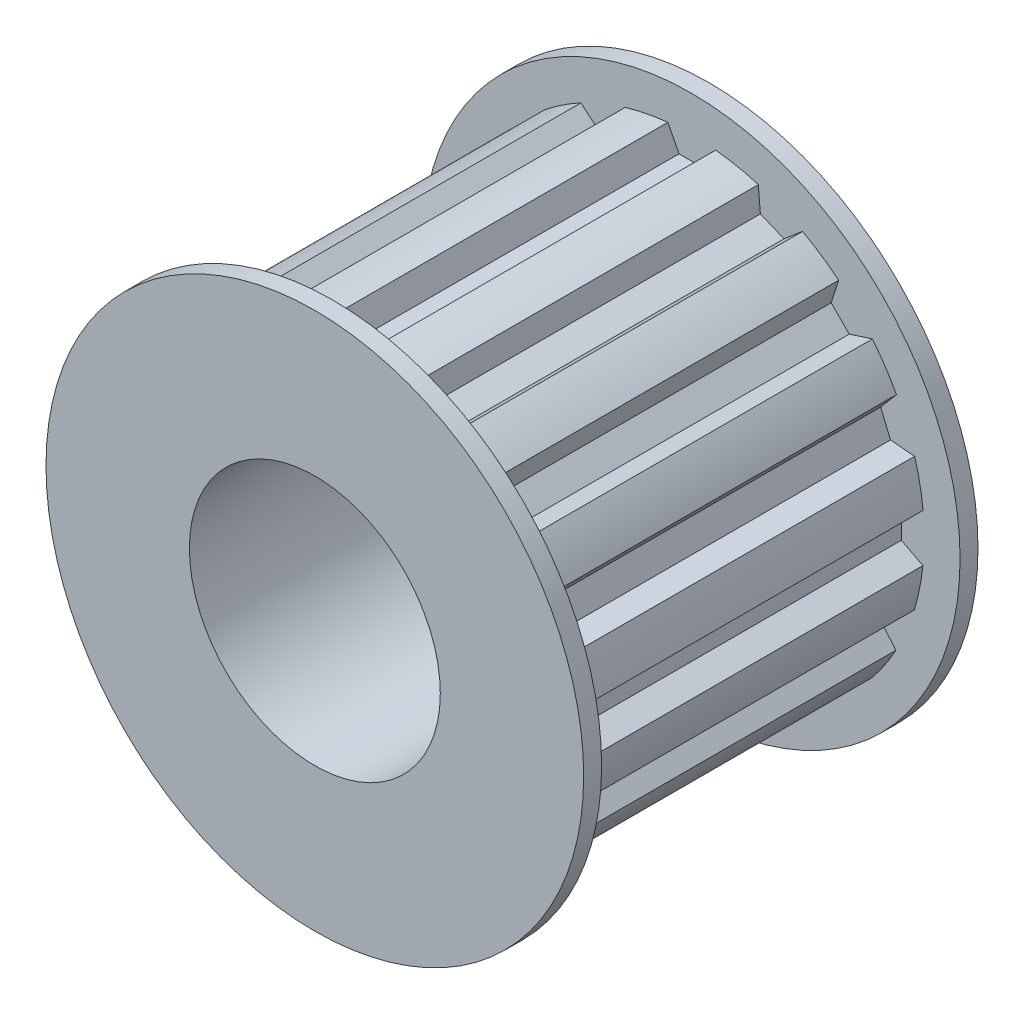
from build123d import *

# Parameters (mm, degrees)
ESQUISSE1_R                  = 13
BOSS_EXTRU_1_DEPTH           = 20
ENL_V_MAT_EXTRU_1_DEPTH      = 20
R_P_TITION_CIRCULAIRE1_COUNT = 16
ESQUISSE3_R                  = 15
BOSS_EXTRU_2_DEPTH           = 1
BOSS_EXTRU_3_START           = 1
ESQUISSE4_R                  = 15
BOSS_EXTRU_3_DEPTH           = 1
ENL_V_MAT_EXTRU_2_REACH      = 32.561
ESQUISSE5_R                  = 7


with BuildPart() as part:
    # Esquisse1 → Boss.-Extru.1 (new body)
    with BuildSketch(Plane.XY):
        Circle(ESQUISSE1_R)
    extrude(amount=BOSS_EXTRU_1_DEPTH)

    # Esquisse2 → Enl_v. mat.-Extru.1 (cut)
    with BuildSketch(Plane.XY.offset(20)):
        Polygon((-1.466828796, 13.250004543), (1.533171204, 13.250004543), (0.747027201, 11.723555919), (-0.680684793, 11.723555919), align=None)
    enl_v_mat_extru_1 = extrude(amount=-ENL_V_MAT_EXTRU_1_DEPTH, mode=Mode.SUBTRACT)

    # R_p_tition circulaire1: Enl_v. mat.-Extru.1 ×16 about axis
    r_p_tition_circulaire1_axis = Axis((0, 0, 0), (0, 0, 1))
    for i in range(1, R_P_TITION_CIRCULAIRE1_COUNT):
        add(enl_v_mat_extru_1.rotate(r_p_tition_circulaire1_axis, i * 360 / R_P_TITION_CIRCULAIRE1_COUNT), mode=Mode.SUBTRACT)

    # Esquisse3 → Boss.-Extru.2 (add)
    with BuildSketch(Plane.XY.offset(20)):
        Circle(ESQUISSE3_R)
    extrude(amount=BOSS_EXTRU_2_DEPTH)

    # Esquisse4 → Boss.-Extru.3 (add)
    with BuildSketch(Plane(origin=(0, 0, 0), x_dir=(-1, 0, 0), z_dir=(0, 0, -1)).offset(BOSS_EXTRU_3_START)):
        with Locations(Location((0, 0, 0), (0, 0, 180))):
            Circle(ESQUISSE4_R)
    extrude(amount=-BOSS_EXTRU_3_DEPTH)

    # Esquisse5 → Enl_v. mat.-Extru.2 (cut, up to next)
    with BuildSketch(Plane(origin=(0, 0, -1), x_dir=(-1, 0, 0), z_dir=(0, 0, -1)), mode=Mode.PRIVATE) as enl_v_mat_extru_2_sk1:
        Circle(ESQUISSE5_R)
    enl_v_mat_extru_2_tool1 = extrude(enl_v_mat_extru_2_sk1.sketch, amount=-ENL_V_MAT_EXTRU_2_REACH, mode=Mode.PRIVATE) & part.part
    add(enl_v_mat_extru_2_tool1.solids().sort_by_distance((0, 0, -1))[0], mode=Mode.SUBTRACT)


solid = part.part
